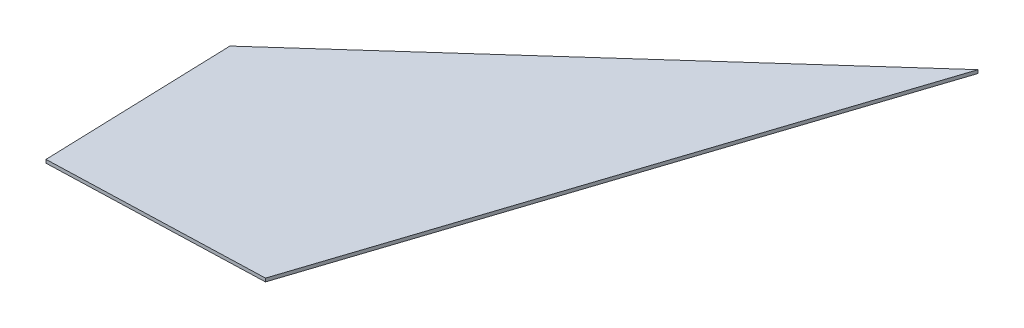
ISO-10303-21;
HEADER;
FILE_DESCRIPTION(('STEP AP214'),'2;1');
FILE_NAME('part.step','',(''),(''),'','','');
FILE_SCHEMA(('AUTOMOTIVE_DESIGN { 1 0 10303 214 1 1 1 1 }'));
ENDSEC;
DATA;
#1=APPLICATION_CONTEXT('core data for automotive mechanical design processes');
#2=APPLICATION_PROTOCOL_DEFINITION('international standard','automotive_design',2000,#1);
#3=PRODUCT_CONTEXT('',#1,'mechanical');
#4=PRODUCT('Part','Part','',(#3));
#5=PRODUCT_RELATED_PRODUCT_CATEGORY('part','',(#4));
#6=PRODUCT_DEFINITION_FORMATION('','',#4);
#7=PRODUCT_DEFINITION_CONTEXT('part definition',#1,'design');
#8=PRODUCT_DEFINITION('design','',#6,#7);
#9=PRODUCT_DEFINITION_SHAPE('','',#8);
#10=(LENGTH_UNIT() NAMED_UNIT(*) SI_UNIT(.MILLI.,.METRE.));
#11=(NAMED_UNIT(*) PLANE_ANGLE_UNIT() SI_UNIT($,.RADIAN.));
#12=(NAMED_UNIT(*) SI_UNIT($,.STERADIAN.) SOLID_ANGLE_UNIT());
#13=UNCERTAINTY_MEASURE_WITH_UNIT(LENGTH_MEASURE(1.E-05),#10,'distance_accuracy_value','');
#14=(GEOMETRIC_REPRESENTATION_CONTEXT(3) GLOBAL_UNCERTAINTY_ASSIGNED_CONTEXT((#13)) GLOBAL_UNIT_ASSIGNED_CONTEXT((#10,
#11,#12)) REPRESENTATION_CONTEXT('',''));
#15=CARTESIAN_POINT('',(0.,0.,0.));
#16=DIRECTION('',(0.,0.,1.));
#17=DIRECTION('',(1.,0.,0.));
#18=AXIS2_PLACEMENT_3D('',#15,#16,#17);
#19=CARTESIAN_POINT('',(6.06298367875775,-1.,75.046221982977));
#20=DIRECTION('',(0.95035675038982,0.,0.311162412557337));
#21=DIRECTION('',(0.311162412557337,0.,-0.95035675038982));
#22=AXIS2_PLACEMENT_3D('',#19,#20,#21);
#23=PLANE('',#22);
#24=DIRECTION('',(0.311162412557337,0.,-0.95035675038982));
#25=VECTOR('',#24,1.);
#26=CARTESIAN_POINT('',(6.06298367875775,0.,75.046221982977));
#27=LINE('',#26,#25);
#28=CARTESIAN_POINT('',(6.06298367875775,0.,75.046221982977));
#29=VERTEX_POINT('',#28);
#30=CARTESIAN_POINT('',(55.8489696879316,0.,-77.0108580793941));
#31=VERTEX_POINT('',#30);
#32=EDGE_CURVE('E129',#29,#31,#27,.T.);
#33=ORIENTED_EDGE('',*,*,#32,.F.);
#34=DIRECTION('',(0.,1.,0.));
#35=VECTOR('',#34,1.);
#36=CARTESIAN_POINT('',(6.06298367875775,-1.,75.046221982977));
#37=LINE('',#36,#35);
#38=CARTESIAN_POINT('',(6.06298367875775,-1.,75.046221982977));
#39=VERTEX_POINT('',#38);
#40=EDGE_CURVE('E11',#39,#29,#37,.T.);
#41=ORIENTED_EDGE('',*,*,#40,.F.);
#42=DIRECTION('',(0.311162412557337,0.,-0.95035675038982));
#43=VECTOR('',#42,1.);
#44=CARTESIAN_POINT('',(6.06298367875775,-1.,75.046221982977));
#45=LINE('',#44,#43);
#46=CARTESIAN_POINT('',(55.8489696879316,-1.,-77.0108580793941));
#47=VERTEX_POINT('',#46);
#48=EDGE_CURVE('E138',#39,#47,#45,.T.);
#49=ORIENTED_EDGE('',*,*,#48,.T.);
#50=DIRECTION('',(0.,1.,0.));
#51=VECTOR('',#50,1.);
#52=CARTESIAN_POINT('',(55.8489696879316,-1.,-77.0108580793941));
#53=LINE('',#52,#51);
#54=EDGE_CURVE('E37',#47,#31,#53,.T.);
#55=ORIENTED_EDGE('',*,*,#54,.T.);
#56=EDGE_LOOP('',(#33,#41,#49,#55));
#57=FACE_BOUND('',#56,.T.);
#58=ADVANCED_FACE('F34',(#57),#23,.T.);
#59=CARTESIAN_POINT('',(-54.0883843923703,-1.,77.0108580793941));
#60=DIRECTION('',(0.0326441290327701,0.,0.99946703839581));
#61=DIRECTION('',(0.99946703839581,0.,-0.0326441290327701));
#62=AXIS2_PLACEMENT_3D('',#59,#60,#61);
#63=PLANE('',#62);
#64=DIRECTION('',(0.99946703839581,0.,-0.0326441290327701));
#65=VECTOR('',#64,1.);
#66=CARTESIAN_POINT('',(-54.0883843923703,0.,77.0108580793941));
#67=LINE('',#66,#65);
#68=CARTESIAN_POINT('',(-54.0883843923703,0.,77.0108580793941));
#69=VERTEX_POINT('',#68);
#70=EDGE_CURVE('E141',#69,#29,#67,.T.);
#71=ORIENTED_EDGE('',*,*,#70,.F.);
#72=DIRECTION('',(0.,1.,0.));
#73=VECTOR('',#72,1.);
#74=CARTESIAN_POINT('',(-54.0883843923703,-1.,77.0108580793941));
#75=LINE('',#74,#73);
#76=CARTESIAN_POINT('',(-54.0883843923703,-1.,77.0108580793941));
#77=VERTEX_POINT('',#76);
#78=EDGE_CURVE('E43',#77,#69,#75,.T.);
#79=ORIENTED_EDGE('',*,*,#78,.F.);
#80=DIRECTION('',(0.99946703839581,0.,-0.0326441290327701));
#81=VECTOR('',#80,1.);
#82=CARTESIAN_POINT('',(-54.0883843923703,-1.,77.0108580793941));
#83=LINE('',#82,#81);
#84=EDGE_CURVE('E145',#77,#39,#83,.T.);
#85=ORIENTED_EDGE('',*,*,#84,.T.);
#86=ORIENTED_EDGE('',*,*,#40,.T.);
#87=EDGE_LOOP('',(#71,#79,#85,#86));
#88=FACE_BOUND('',#87,.T.);
#89=ADVANCED_FACE('F160',(#88),#63,.T.);
#90=CARTESIAN_POINT('',(-55.8489696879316,-1.,23.1069242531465));
#91=DIRECTION('',(-0.99946703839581,0.,0.0326441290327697));
#92=DIRECTION('',(0.0326441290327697,0.,0.99946703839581));
#93=AXIS2_PLACEMENT_3D('',#90,#91,#92);
#94=PLANE('',#93);
#95=DIRECTION('',(0.0326441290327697,0.,0.99946703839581));
#96=VECTOR('',#95,1.);
#97=CARTESIAN_POINT('',(-55.8489696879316,0.,23.1069242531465));
#98=LINE('',#97,#96);
#99=CARTESIAN_POINT('',(-55.8489696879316,0.,23.1069242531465));
#100=VERTEX_POINT('',#99);
#101=EDGE_CURVE('E149',#100,#69,#98,.T.);
#102=ORIENTED_EDGE('',*,*,#101,.F.);
#103=DIRECTION('',(0.,1.,0.));
#104=VECTOR('',#103,1.);
#105=CARTESIAN_POINT('',(-55.8489696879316,-1.,23.1069242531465));
#106=LINE('',#105,#104);
#107=CARTESIAN_POINT('',(-55.8489696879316,-1.,23.1069242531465));
#108=VERTEX_POINT('',#107);
#109=EDGE_CURVE('E154',#108,#100,#106,.T.);
#110=ORIENTED_EDGE('',*,*,#109,.F.);
#111=DIRECTION('',(0.0326441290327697,0.,0.99946703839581));
#112=VECTOR('',#111,1.);
#113=CARTESIAN_POINT('',(-55.8489696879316,-1.,23.1069242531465));
#114=LINE('',#113,#112);
#115=EDGE_CURVE('E143',#108,#77,#114,.T.);
#116=ORIENTED_EDGE('',*,*,#115,.T.);
#117=ORIENTED_EDGE('',*,*,#78,.T.);
#118=EDGE_LOOP('',(#102,#110,#116,#117));
#119=FACE_BOUND('',#118,.T.);
#120=ADVANCED_FACE('F163',(#119),#94,.T.);
#121=CARTESIAN_POINT('',(55.8489696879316,-1.,-77.0108580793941));
#122=DIRECTION('',(-0.667451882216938,0.,-0.744652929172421));
#123=DIRECTION('',(-0.744652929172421,0.,0.667451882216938));
#124=AXIS2_PLACEMENT_3D('',#121,#122,#123);
#125=PLANE('',#124);
#126=DIRECTION('',(-0.744652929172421,0.,0.667451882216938));
#127=VECTOR('',#126,1.);
#128=CARTESIAN_POINT('',(55.8489696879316,0.,-77.0108580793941));
#129=LINE('',#128,#127);
#130=EDGE_CURVE('E132',#31,#100,#129,.T.);
#131=ORIENTED_EDGE('',*,*,#130,.F.);
#132=ORIENTED_EDGE('',*,*,#54,.F.);
#133=DIRECTION('',(-0.744652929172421,0.,0.667451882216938));
#134=VECTOR('',#133,1.);
#135=CARTESIAN_POINT('',(55.8489696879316,-1.,-77.0108580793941));
#136=LINE('',#135,#134);
#137=EDGE_CURVE('E140',#47,#108,#136,.T.);
#138=ORIENTED_EDGE('',*,*,#137,.T.);
#139=ORIENTED_EDGE('',*,*,#109,.T.);
#140=EDGE_LOOP('',(#131,#132,#138,#139));
#141=FACE_BOUND('',#140,.T.);
#142=ADVANCED_FACE('F156',(#141),#125,.T.);
#143=CARTESIAN_POINT('',(0.,-1.,0.));
#144=DIRECTION('',(0.,-1.,0.));
#145=DIRECTION('',(0.,0.,-1.));
#146=AXIS2_PLACEMENT_3D('',#143,#144,#145);
#147=PLANE('',#146);
#148=ORIENTED_EDGE('',*,*,#48,.F.);
#149=ORIENTED_EDGE('',*,*,#84,.F.);
#150=ORIENTED_EDGE('',*,*,#115,.F.);
#151=ORIENTED_EDGE('',*,*,#137,.F.);
#152=EDGE_LOOP('',(#148,#149,#150,#151));
#153=FACE_BOUND('',#152,.T.);
#154=ADVANCED_FACE('F165',(#153),#147,.T.);
#155=CARTESIAN_POINT('',(-57.8783481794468,1.,22.2400942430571));
#156=DIRECTION('',(0.99946703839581,0.,-0.0326441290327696));
#157=DIRECTION('',(-0.0326441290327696,0.,-0.99946703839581));
#158=AXIS2_PLACEMENT_3D('',#155,#156,#157);
#159=PLANE('',#158);
#160=DIRECTION('',(0.0326441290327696,0.,0.99946703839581));
#161=VECTOR('',#160,1.);
#162=CARTESIAN_POINT('',(-57.8783481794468,0.,22.2400942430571));
#163=LINE('',#162,#161);
#164=CARTESIAN_POINT('',(-57.8783481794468,0.,22.2400942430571));
#165=VERTEX_POINT('',#164);
#166=CARTESIAN_POINT('',(-56.0220302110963,0.,79.0750804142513));
#167=VERTEX_POINT('',#166);
#168=EDGE_CURVE('E128',#165,#167,#163,.T.);
#169=ORIENTED_EDGE('',*,*,#168,.T.);
#170=DIRECTION('',(0.,-1.,0.));
#171=VECTOR('',#170,1.);
#172=CARTESIAN_POINT('',(-56.0220302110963,1.,79.0750804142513));
#173=LINE('',#172,#171);
#174=CARTESIAN_POINT('',(-56.0220302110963,1.,79.0750804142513));
#175=VERTEX_POINT('',#174);
#176=EDGE_CURVE('E108',#175,#167,#173,.T.);
#177=ORIENTED_EDGE('',*,*,#176,.F.);
#178=DIRECTION('',(0.0326441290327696,0.,0.99946703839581));
#179=VECTOR('',#178,1.);
#180=CARTESIAN_POINT('',(-57.8783481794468,1.,22.2400942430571));
#181=LINE('',#180,#179);
#182=CARTESIAN_POINT('',(-57.8783481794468,1.,22.2400942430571));
#183=VERTEX_POINT('',#182);
#184=EDGE_CURVE('E115',#183,#175,#181,.T.);
#185=ORIENTED_EDGE('',*,*,#184,.F.);
#186=DIRECTION('',(0.,-1.,0.));
#187=VECTOR('',#186,1.);
#188=CARTESIAN_POINT('',(-57.8783481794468,1.,22.2400942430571));
#189=LINE('',#188,#187);
#190=EDGE_CURVE('E245',#183,#165,#189,.T.);
#191=ORIENTED_EDGE('',*,*,#190,.T.);
#192=EDGE_LOOP('',(#169,#177,#185,#191));
#193=FACE_BOUND('',#192,.T.);
#194=ADVANCED_FACE('F126',(#193),#159,.F.);
#195=CARTESIAN_POINT('',(-56.0220302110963,1.,79.0750804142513));
#196=DIRECTION('',(-0.03264412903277,0.,-0.99946703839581));
#197=DIRECTION('',(-0.99946703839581,0.,0.03264412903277));
#198=AXIS2_PLACEMENT_3D('',#195,#196,#197);
#199=PLANE('',#198);
#200=DIRECTION('',(0.99946703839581,0.,-0.03264412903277));
#201=VECTOR('',#200,1.);
#202=CARTESIAN_POINT('',(-56.0220302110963,0.,79.0750804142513));
#203=LINE('',#202,#201);
#204=CARTESIAN_POINT('',(7.52794064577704,0.,76.9994407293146));
#205=VERTEX_POINT('',#204);
#206=EDGE_CURVE('E251',#167,#205,#203,.T.);
#207=ORIENTED_EDGE('',*,*,#206,.T.);
#208=DIRECTION('',(0.,-1.,0.));
#209=VECTOR('',#208,1.);
#210=CARTESIAN_POINT('',(7.52794064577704,1.,76.9994407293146));
#211=LINE('',#210,#209);
#212=CARTESIAN_POINT('',(7.52794064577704,1.,76.9994407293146));
#213=VERTEX_POINT('',#212);
#214=EDGE_CURVE('E111',#213,#205,#211,.T.);
#215=ORIENTED_EDGE('',*,*,#214,.F.);
#216=DIRECTION('',(0.99946703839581,0.,-0.03264412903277));
#217=VECTOR('',#216,1.);
#218=CARTESIAN_POINT('',(-56.0220302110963,1.,79.0750804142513));
#219=LINE('',#218,#217);
#220=EDGE_CURVE('E104',#175,#213,#219,.T.);
#221=ORIENTED_EDGE('',*,*,#220,.F.);
#222=ORIENTED_EDGE('',*,*,#176,.T.);
#223=EDGE_LOOP('',(#207,#215,#221,#222));
#224=FACE_BOUND('',#223,.T.);
#225=ADVANCED_FACE('F106',(#224),#199,.F.);
#226=CARTESIAN_POINT('',(7.52794064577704,1.,76.9994407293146));
#227=DIRECTION('',(-0.95035675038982,0.,-0.311162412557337));
#228=DIRECTION('',(-0.311162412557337,0.,0.95035675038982));
#229=AXIS2_PLACEMENT_3D('',#226,#227,#228);
#230=PLANE('',#229);
#231=DIRECTION('',(0.311162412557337,0.,-0.95035675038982));
#232=VECTOR('',#231,1.);
#233=CARTESIAN_POINT('',(7.52794064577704,0.,76.9994407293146));
#234=LINE('',#233,#232);
#235=CARTESIAN_POINT('',(60.0722310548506,0.,-83.4820926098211));
#236=VERTEX_POINT('',#235);
#237=EDGE_CURVE('E248',#205,#236,#234,.T.);
#238=ORIENTED_EDGE('',*,*,#237,.T.);
#239=DIRECTION('',(0.,-1.,0.));
#240=VECTOR('',#239,1.);
#241=CARTESIAN_POINT('',(60.0722310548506,1.,-83.4820926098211));
#242=LINE('',#241,#240);
#243=CARTESIAN_POINT('',(60.0722310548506,1.,-83.4820926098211));
#244=VERTEX_POINT('',#243);
#245=EDGE_CURVE('E134',#244,#236,#242,.T.);
#246=ORIENTED_EDGE('',*,*,#245,.F.);
#247=DIRECTION('',(0.311162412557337,0.,-0.95035675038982));
#248=VECTOR('',#247,1.);
#249=CARTESIAN_POINT('',(7.52794064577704,1.,76.9994407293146));
#250=LINE('',#249,#248);
#251=EDGE_CURVE('E114',#213,#244,#250,.T.);
#252=ORIENTED_EDGE('',*,*,#251,.F.);
#253=ORIENTED_EDGE('',*,*,#214,.T.);
#254=EDGE_LOOP('',(#238,#246,#252,#253));
#255=FACE_BOUND('',#254,.T.);
#256=ADVANCED_FACE('F204',(#255),#230,.F.);
#257=CARTESIAN_POINT('',(60.0722310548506,1.,-83.4820926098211));
#258=DIRECTION('',(0.667451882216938,0.,0.744652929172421));
#259=DIRECTION('',(0.744652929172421,0.,-0.667451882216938));
#260=AXIS2_PLACEMENT_3D('',#257,#258,#259);
#261=PLANE('',#260);
#262=DIRECTION('',(-0.744652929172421,0.,0.667451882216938));
#263=VECTOR('',#262,1.);
#264=CARTESIAN_POINT('',(60.0722310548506,0.,-83.4820926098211));
#265=LINE('',#264,#263);
#266=EDGE_CURVE('E124',#236,#165,#265,.T.);
#267=ORIENTED_EDGE('',*,*,#266,.T.);
#268=ORIENTED_EDGE('',*,*,#190,.F.);
#269=DIRECTION('',(-0.744652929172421,0.,0.667451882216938));
#270=VECTOR('',#269,1.);
#271=CARTESIAN_POINT('',(60.0722310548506,1.,-83.4820926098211));
#272=LINE('',#271,#270);
#273=EDGE_CURVE('E120',#244,#183,#272,.T.);
#274=ORIENTED_EDGE('',*,*,#273,.F.);
#275=ORIENTED_EDGE('',*,*,#245,.T.);
#276=EDGE_LOOP('',(#267,#268,#274,#275));
#277=FACE_BOUND('',#276,.T.);
#278=ADVANCED_FACE('F213',(#277),#261,.F.);
#279=CARTESIAN_POINT('',(0.,1.,0.));
#280=DIRECTION('',(0.,1.,0.));
#281=DIRECTION('',(0.,0.,1.));
#282=AXIS2_PLACEMENT_3D('',#279,#280,#281);
#283=PLANE('',#282);
#284=ORIENTED_EDGE('',*,*,#184,.T.);
#285=ORIENTED_EDGE('',*,*,#220,.T.);
#286=ORIENTED_EDGE('',*,*,#251,.T.);
#287=ORIENTED_EDGE('',*,*,#273,.T.);
#288=EDGE_LOOP('',(#284,#285,#286,#287));
#289=FACE_BOUND('',#288,.T.);
#290=ADVANCED_FACE('F118',(#289),#283,.T.);
#291=CARTESIAN_POINT('',(0.,0.,0.));
#292=DIRECTION('',(0.,1.,0.));
#293=DIRECTION('',(0.,0.,1.));
#294=AXIS2_PLACEMENT_3D('',#291,#292,#293);
#295=PLANE('',#294);
#296=ORIENTED_EDGE('',*,*,#32,.T.);
#297=ORIENTED_EDGE('',*,*,#130,.T.);
#298=ORIENTED_EDGE('',*,*,#101,.T.);
#299=ORIENTED_EDGE('',*,*,#70,.T.);
#300=EDGE_LOOP('',(#296,#297,#298,#299));
#301=FACE_BOUND('',#300,.T.);
#302=ORIENTED_EDGE('',*,*,#168,.F.);
#303=ORIENTED_EDGE('',*,*,#266,.F.);
#304=ORIENTED_EDGE('',*,*,#237,.F.);
#305=ORIENTED_EDGE('',*,*,#206,.F.);
#306=EDGE_LOOP('',(#302,#303,#304,#305));
#307=FACE_BOUND('',#306,.T.);
#308=ADVANCED_FACE('F158',(#301,#307),#295,.F.);
#309=CLOSED_SHELL('',(#58,#89,#120,#142,#154,#194,#225,#256,#278,#290,#308));
#310=MANIFOLD_SOLID_BREP('B2',#309);
#311=ADVANCED_BREP_SHAPE_REPRESENTATION('',(#18,#310),#14);
#312=SHAPE_DEFINITION_REPRESENTATION(#9,#311);
ENDSEC;
END-ISO-10303-21;
